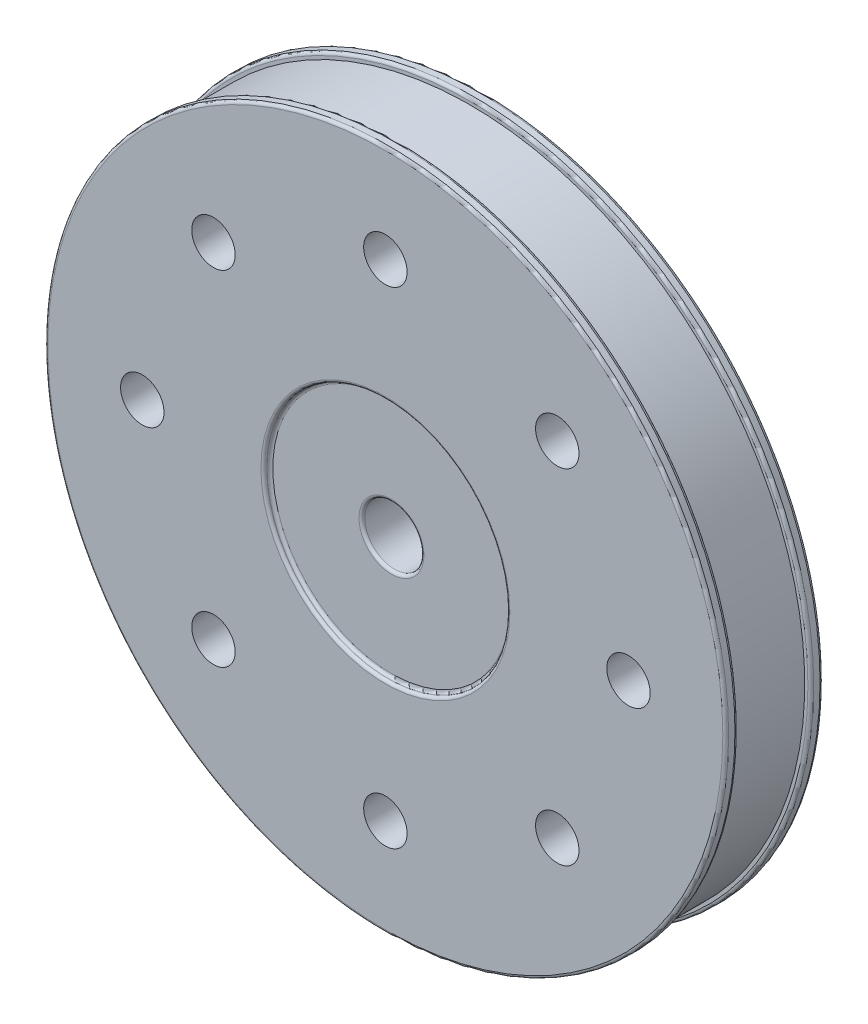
ISO-10303-21;
HEADER;
FILE_DESCRIPTION(('STEP AP214'),'2;1');
FILE_NAME('part.step','',(''),(''),'','','');
FILE_SCHEMA(('AUTOMOTIVE_DESIGN { 1 0 10303 214 1 1 1 1 }'));
ENDSEC;
DATA;
#1=APPLICATION_CONTEXT('core data for automotive mechanical design processes');
#2=APPLICATION_PROTOCOL_DEFINITION('international standard','automotive_design',2000,#1);
#3=PRODUCT_CONTEXT('',#1,'mechanical');
#4=PRODUCT('Part','Part','',(#3));
#5=PRODUCT_RELATED_PRODUCT_CATEGORY('part','',(#4));
#6=PRODUCT_DEFINITION_FORMATION('','',#4);
#7=PRODUCT_DEFINITION_CONTEXT('part definition',#1,'design');
#8=PRODUCT_DEFINITION('design','',#6,#7);
#9=PRODUCT_DEFINITION_SHAPE('','',#8);
#10=(LENGTH_UNIT() NAMED_UNIT(*) SI_UNIT(.MILLI.,.METRE.));
#11=(NAMED_UNIT(*) PLANE_ANGLE_UNIT() SI_UNIT($,.RADIAN.));
#12=(NAMED_UNIT(*) SI_UNIT($,.STERADIAN.) SOLID_ANGLE_UNIT());
#13=UNCERTAINTY_MEASURE_WITH_UNIT(LENGTH_MEASURE(1.E-05),#10,'distance_accuracy_value','');
#14=(GEOMETRIC_REPRESENTATION_CONTEXT(3) GLOBAL_UNCERTAINTY_ASSIGNED_CONTEXT((#13)) GLOBAL_UNIT_ASSIGNED_CONTEXT((#10,
#11,#12)) REPRESENTATION_CONTEXT('',''));
#15=CARTESIAN_POINT('',(0.,0.,0.));
#16=DIRECTION('',(0.,0.,1.));
#17=DIRECTION('',(1.,0.,0.));
#18=AXIS2_PLACEMENT_3D('',#15,#16,#17);
#19=CARTESIAN_POINT('',(0.,14.2875000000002,0.));
#20=DIRECTION('',(0.,0.,-1.));
#21=DIRECTION('',(-1.,0.,0.));
#22=AXIS2_PLACEMENT_3D('',#19,#20,#21);
#23=PLANE('',#22);
#24=CARTESIAN_POINT('',(0.,0.,0.));
#25=DIRECTION('',(0.,0.,1.));
#26=DIRECTION('',(1.,0.,0.));
#27=AXIS2_PLACEMENT_3D('',#24,#25,#26);
#28=CIRCLE('',#27,7.71795209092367);
#29=CARTESIAN_POINT('',(7.71795209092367,0.,0.));
#30=VERTEX_POINT('',#29);
#31=EDGE_CURVE('E101',#30,#30,#28,.T.);
#32=ORIENTED_EDGE('',*,*,#31,.T.);
#33=EDGE_LOOP('',(#32));
#34=FACE_BOUND('',#33,.T.);
#35=CARTESIAN_POINT('',(0.,0.,0.));
#36=DIRECTION('',(0.,0.,-1.));
#37=DIRECTION('',(-1.,0.,0.));
#38=AXIS2_PLACEMENT_3D('',#35,#36,#37);
#39=CIRCLE('',#38,14.2875);
#40=CARTESIAN_POINT('',(-14.2875,0.,0.));
#41=VERTEX_POINT('',#40);
#42=EDGE_CURVE('E83',#41,#41,#39,.T.);
#43=ORIENTED_EDGE('',*,*,#42,.T.);
#44=EDGE_LOOP('',(#43));
#45=FACE_BOUND('',#44,.T.);
#46=ADVANCED_FACE('F33',(#34,#45),#23,.T.);
#47=CARTESIAN_POINT('',(0.,0.,0.));
#48=DIRECTION('',(0.,0.,-1.));
#49=DIRECTION('',(-1.,0.,0.));
#50=AXIS2_PLACEMENT_3D('',#47,#48,#49);
#51=CYLINDRICAL_SURFACE('',#50,14.2875);
#52=CARTESIAN_POINT('',(2.22044604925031E-13,0.,20.6375));
#53=DIRECTION('',(0.,0.,-1.));
#54=DIRECTION('',(-1.,0.,0.));
#55=AXIS2_PLACEMENT_3D('',#52,#53,#54);
#56=CIRCLE('',#55,14.2875);
#57=CARTESIAN_POINT('',(-14.2874999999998,0.,20.6375));
#58=VERTEX_POINT('',#57);
#59=EDGE_CURVE('E86',#58,#58,#56,.T.);
#60=ORIENTED_EDGE('',*,*,#59,.T.);
#61=EDGE_LOOP('',(#60));
#62=FACE_BOUND('',#61,.T.);
#63=ORIENTED_EDGE('',*,*,#42,.F.);
#64=EDGE_LOOP('',(#63));
#65=FACE_BOUND('',#64,.T.);
#66=ADVANCED_FACE('F191',(#62,#65),#51,.T.);
#67=CARTESIAN_POINT('',(1.11022302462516E-13,31.7500000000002,20.6375));
#68=DIRECTION('',(0.,0.,-1.));
#69=DIRECTION('',(-1.,0.,0.));
#70=AXIS2_PLACEMENT_3D('',#67,#68,#69);
#71=PLANE('',#70);
#72=CARTESIAN_POINT('',(2.22044604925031E-13,0.,20.6375));
#73=DIRECTION('',(0.,0.,-1.));
#74=DIRECTION('',(-1.,0.,0.));
#75=AXIS2_PLACEMENT_3D('',#72,#73,#74);
#76=CIRCLE('',#75,31.75);
#77=CARTESIAN_POINT('',(-31.7499999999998,0.,20.6375));
#78=VERTEX_POINT('',#77);
#79=EDGE_CURVE('E89',#78,#78,#76,.T.);
#80=ORIENTED_EDGE('',*,*,#79,.T.);
#81=EDGE_LOOP('',(#80));
#82=FACE_BOUND('',#81,.T.);
#83=ORIENTED_EDGE('',*,*,#59,.F.);
#84=EDGE_LOOP('',(#83));
#85=FACE_BOUND('',#84,.T.);
#86=ADVANCED_FACE('F197',(#82,#85),#71,.T.);
#87=CARTESIAN_POINT('',(0.,0.,0.));
#88=DIRECTION('',(0.,0.,-1.));
#89=DIRECTION('',(-1.,0.,0.));
#90=AXIS2_PLACEMENT_3D('',#87,#88,#89);
#91=CYLINDRICAL_SURFACE('',#90,31.75);
#92=CARTESIAN_POINT('',(2.22044604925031E-13,0.,19.05));
#93=DIRECTION('',(0.,0.,-1.));
#94=DIRECTION('',(-1.,0.,0.));
#95=AXIS2_PLACEMENT_3D('',#92,#93,#94);
#96=CIRCLE('',#95,31.75);
#97=CARTESIAN_POINT('',(-31.7499999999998,0.,19.05));
#98=VERTEX_POINT('',#97);
#99=EDGE_CURVE('E92',#98,#98,#96,.T.);
#100=ORIENTED_EDGE('',*,*,#99,.T.);
#101=EDGE_LOOP('',(#100));
#102=FACE_BOUND('',#101,.T.);
#103=ORIENTED_EDGE('',*,*,#79,.F.);
#104=EDGE_LOOP('',(#103));
#105=FACE_BOUND('',#104,.T.);
#106=ADVANCED_FACE('F262',(#102,#105),#91,.F.);
#107=CARTESIAN_POINT('',(1.11022302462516E-13,88.9000000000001,19.05));
#108=DIRECTION('',(0.,0.,-1.));
#109=DIRECTION('',(-1.,0.,0.));
#110=AXIS2_PLACEMENT_3D('',#107,#108,#109);
#111=PLANE('',#110);
#112=CARTESIAN_POINT('',(44.9012806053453,44.9012806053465,19.05));
#113=DIRECTION('',(0.,0.,-1.));
#114=DIRECTION('',(-1.,0.,0.));
#115=AXIS2_PLACEMENT_3D('',#112,#113,#114);
#116=CIRCLE('',#115,5.67274811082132);
#117=CARTESIAN_POINT('',(39.228532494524,44.9012806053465,19.05));
#118=VERTEX_POINT('',#117);
#119=EDGE_CURVE('E146',#118,#118,#116,.T.);
#120=ORIENTED_EDGE('',*,*,#119,.F.);
#121=EDGE_LOOP('',(#120));
#122=FACE_BOUND('',#121,.T.);
#123=CARTESIAN_POINT('',(63.5000000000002,7.21644966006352E-13,19.05));
#124=DIRECTION('',(0.,0.,-1.));
#125=DIRECTION('',(-1.,0.,0.));
#126=AXIS2_PLACEMENT_3D('',#123,#124,#125);
#127=CIRCLE('',#126,5.67274811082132);
#128=CARTESIAN_POINT('',(57.8272518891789,7.21644966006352E-13,19.05));
#129=VERTEX_POINT('',#128);
#130=EDGE_CURVE('E140',#129,#129,#127,.T.);
#131=ORIENTED_EDGE('',*,*,#130,.F.);
#132=EDGE_LOOP('',(#131));
#133=FACE_BOUND('',#132,.T.);
#134=CARTESIAN_POINT('',(44.9012806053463,-44.9012806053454,19.05));
#135=DIRECTION('',(0.,0.,-1.));
#136=DIRECTION('',(-1.,0.,0.));
#137=AXIS2_PLACEMENT_3D('',#134,#135,#136);
#138=CIRCLE('',#137,5.67274811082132);
#139=CARTESIAN_POINT('',(39.2285324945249,-44.9012806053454,19.05));
#140=VERTEX_POINT('',#139);
#141=EDGE_CURVE('E134',#140,#140,#138,.T.);
#142=ORIENTED_EDGE('',*,*,#141,.F.);
#143=EDGE_LOOP('',(#142));
#144=FACE_BOUND('',#143,.T.);
#145=CARTESIAN_POINT('',(5.55111512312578E-13,-63.4999999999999,19.05));
#146=DIRECTION('',(0.,0.,-1.));
#147=DIRECTION('',(-1.,0.,0.));
#148=AXIS2_PLACEMENT_3D('',#145,#146,#147);
#149=CIRCLE('',#148,5.67274811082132);
#150=CARTESIAN_POINT('',(-5.67274811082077,-63.4999999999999,19.05));
#151=VERTEX_POINT('',#150);
#152=EDGE_CURVE('E128',#151,#151,#149,.T.);
#153=ORIENTED_EDGE('',*,*,#152,.F.);
#154=EDGE_LOOP('',(#153));
#155=FACE_BOUND('',#154,.T.);
#156=CARTESIAN_POINT('',(-44.9012806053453,-44.901280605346,19.05));
#157=DIRECTION('',(0.,0.,-1.));
#158=DIRECTION('',(-1.,0.,0.));
#159=AXIS2_PLACEMENT_3D('',#156,#157,#158);
#160=CIRCLE('',#159,5.67274811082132);
#161=CARTESIAN_POINT('',(-50.5740287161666,-44.901280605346,19.05));
#162=VERTEX_POINT('',#161);
#163=EDGE_CURVE('E122',#162,#162,#160,.T.);
#164=ORIENTED_EDGE('',*,*,#163,.F.);
#165=EDGE_LOOP('',(#164));
#166=FACE_BOUND('',#165,.T.);
#167=CARTESIAN_POINT('',(-63.4999999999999,0.,19.05));
#168=DIRECTION('',(0.,0.,-1.));
#169=DIRECTION('',(-1.,0.,0.));
#170=AXIS2_PLACEMENT_3D('',#167,#168,#169);
#171=CIRCLE('',#170,5.67274811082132);
#172=CARTESIAN_POINT('',(-69.1727481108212,0.,19.05));
#173=VERTEX_POINT('',#172);
#174=EDGE_CURVE('E116',#173,#173,#171,.T.);
#175=ORIENTED_EDGE('',*,*,#174,.F.);
#176=EDGE_LOOP('',(#175));
#177=FACE_BOUND('',#176,.T.);
#178=CARTESIAN_POINT('',(-44.9012806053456,44.9012806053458,19.05));
#179=DIRECTION('',(0.,0.,-1.));
#180=DIRECTION('',(-1.,0.,0.));
#181=AXIS2_PLACEMENT_3D('',#178,#179,#180);
#182=CIRCLE('',#181,5.67274811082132);
#183=CARTESIAN_POINT('',(-50.574028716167,44.9012806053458,19.05));
#184=VERTEX_POINT('',#183);
#185=EDGE_CURVE('E110',#184,#184,#182,.T.);
#186=ORIENTED_EDGE('',*,*,#185,.F.);
#187=EDGE_LOOP('',(#186));
#188=FACE_BOUND('',#187,.T.);
#189=CARTESIAN_POINT('',(2.22044604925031E-13,63.5,19.05));
#190=DIRECTION('',(0.,0.,-1.));
#191=DIRECTION('',(-1.,0.,0.));
#192=AXIS2_PLACEMENT_3D('',#189,#190,#191);
#193=CIRCLE('',#192,5.67274811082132);
#194=CARTESIAN_POINT('',(-5.6727481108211,63.5,19.05));
#195=VERTEX_POINT('',#194);
#196=EDGE_CURVE('E104',#195,#195,#193,.T.);
#197=ORIENTED_EDGE('',*,*,#196,.F.);
#198=EDGE_LOOP('',(#197));
#199=FACE_BOUND('',#198,.T.);
#200=CARTESIAN_POINT('',(2.22044604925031E-13,0.,19.05));
#201=DIRECTION('',(0.,0.,-1.));
#202=DIRECTION('',(-1.,0.,0.));
#203=AXIS2_PLACEMENT_3D('',#200,#201,#202);
#204=CIRCLE('',#203,88.138);
#205=CARTESIAN_POINT('',(-88.1379999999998,0.,19.05));
#206=VERTEX_POINT('',#205);
#207=EDGE_CURVE('E71',#206,#206,#204,.T.);
#208=ORIENTED_EDGE('',*,*,#207,.T.);
#209=EDGE_LOOP('',(#208));
#210=FACE_BOUND('',#209,.T.);
#211=ORIENTED_EDGE('',*,*,#99,.F.);
#212=EDGE_LOOP('',(#211));
#213=FACE_BOUND('',#212,.T.);
#214=ADVANCED_FACE('F258',(#122,#133,#144,#155,#166,#177,#188,#199,#210,#213),#111,.T.);
#215=CARTESIAN_POINT('',(0.,0.,0.));
#216=DIRECTION('',(0.,0.,-1.));
#217=DIRECTION('',(-1.,0.,0.));
#218=AXIS2_PLACEMENT_3D('',#215,#216,#217);
#219=CYLINDRICAL_SURFACE('',#218,88.9);
#220=CARTESIAN_POINT('',(2.22044604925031E-13,0.,19.812));
#221=DIRECTION('',(0.,0.,-1.));
#222=DIRECTION('',(-1.,0.,0.));
#223=AXIS2_PLACEMENT_3D('',#220,#221,#222);
#224=CIRCLE('',#223,88.9);
#225=CARTESIAN_POINT('',(-88.8999999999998,0.,19.812));
#226=VERTEX_POINT('',#225);
#227=EDGE_CURVE('E65',#226,#226,#224,.F.);
#228=ORIENTED_EDGE('',*,*,#227,.T.);
#229=EDGE_LOOP('',(#228));
#230=FACE_BOUND('',#229,.T.);
#231=CARTESIAN_POINT('',(2.22044604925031E-13,0.,21.463));
#232=DIRECTION('',(0.,0.,1.));
#233=DIRECTION('',(1.,0.,0.));
#234=AXIS2_PLACEMENT_3D('',#231,#232,#233);
#235=CIRCLE('',#234,88.9);
#236=CARTESIAN_POINT('',(88.9000000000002,0.,21.463));
#237=VERTEX_POINT('',#236);
#238=EDGE_CURVE('E68',#237,#237,#235,.F.);
#239=ORIENTED_EDGE('',*,*,#238,.T.);
#240=EDGE_LOOP('',(#239));
#241=FACE_BOUND('',#240,.T.);
#242=ADVANCED_FACE('F254',(#230,#241),#219,.T.);
#243=CARTESIAN_POINT('',(2.22044604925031E-13,87.3125000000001,22.225));
#244=DIRECTION('',(0.,0.,1.));
#245=DIRECTION('',(1.,0.,0.));
#246=AXIS2_PLACEMENT_3D('',#243,#244,#245);
#247=PLANE('',#246);
#248=CARTESIAN_POINT('',(2.22044604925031E-13,0.,22.225));
#249=DIRECTION('',(0.,0.,1.));
#250=DIRECTION('',(1.,0.,0.));
#251=AXIS2_PLACEMENT_3D('',#248,#249,#250);
#252=CIRCLE('',#251,88.138);
#253=CARTESIAN_POINT('',(88.1380000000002,0.,22.225));
#254=VERTEX_POINT('',#253);
#255=EDGE_CURVE('E62',#254,#254,#252,.T.);
#256=ORIENTED_EDGE('',*,*,#255,.T.);
#257=EDGE_LOOP('',(#256));
#258=FACE_BOUND('',#257,.T.);
#259=CARTESIAN_POINT('',(2.22044604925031E-13,0.,22.225));
#260=DIRECTION('',(0.,0.,-1.));
#261=DIRECTION('',(-1.,0.,0.));
#262=AXIS2_PLACEMENT_3D('',#259,#260,#261);
#263=CIRCLE('',#262,87.3125);
#264=CARTESIAN_POINT('',(-87.3124999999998,0.,22.225));
#265=VERTEX_POINT('',#264);
#266=EDGE_CURVE('E95',#265,#265,#263,.T.);
#267=ORIENTED_EDGE('',*,*,#266,.T.);
#268=EDGE_LOOP('',(#267));
#269=FACE_BOUND('',#268,.T.);
#270=ADVANCED_FACE('F250',(#258,#269),#247,.T.);
#271=CARTESIAN_POINT('',(0.,0.,0.));
#272=DIRECTION('',(0.,0.,-1.));
#273=DIRECTION('',(-1.,0.,0.));
#274=AXIS2_PLACEMENT_3D('',#271,#272,#273);
#275=CYLINDRICAL_SURFACE('',#274,87.3125);
#276=CARTESIAN_POINT('',(0.,0.,41.275));
#277=DIRECTION('',(0.,0.,-1.));
#278=DIRECTION('',(-1.,0.,0.));
#279=AXIS2_PLACEMENT_3D('',#276,#277,#278);
#280=CIRCLE('',#279,87.3125);
#281=CARTESIAN_POINT('',(-87.3125,0.,41.275));
#282=VERTEX_POINT('',#281);
#283=EDGE_CURVE('E98',#282,#282,#280,.T.);
#284=ORIENTED_EDGE('',*,*,#283,.T.);
#285=EDGE_LOOP('',(#284));
#286=FACE_BOUND('',#285,.T.);
#287=ORIENTED_EDGE('',*,*,#266,.F.);
#288=EDGE_LOOP('',(#287));
#289=FACE_BOUND('',#288,.T.);
#290=ADVANCED_FACE('F246',(#286,#289),#275,.T.);
#291=CARTESIAN_POINT('',(0.,88.9000000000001,41.275));
#292=DIRECTION('',(0.,0.,-1.));
#293=DIRECTION('',(-1.,0.,0.));
#294=AXIS2_PLACEMENT_3D('',#291,#292,#293);
#295=PLANE('',#294);
#296=CARTESIAN_POINT('',(0.,0.,41.275));
#297=DIRECTION('',(0.,0.,-1.));
#298=DIRECTION('',(-1.,0.,0.));
#299=AXIS2_PLACEMENT_3D('',#296,#297,#298);
#300=CIRCLE('',#299,88.138);
#301=CARTESIAN_POINT('',(-88.138,0.,41.275));
#302=VERTEX_POINT('',#301);
#303=EDGE_CURVE('E59',#302,#302,#300,.T.);
#304=ORIENTED_EDGE('',*,*,#303,.T.);
#305=EDGE_LOOP('',(#304));
#306=FACE_BOUND('',#305,.T.);
#307=ORIENTED_EDGE('',*,*,#283,.F.);
#308=EDGE_LOOP('',(#307));
#309=FACE_BOUND('',#308,.T.);
#310=ADVANCED_FACE('F242',(#306,#309),#295,.T.);
#311=CARTESIAN_POINT('',(0.,0.,0.));
#312=DIRECTION('',(0.,0.,-1.));
#313=DIRECTION('',(-1.,0.,0.));
#314=AXIS2_PLACEMENT_3D('',#311,#312,#313);
#315=CYLINDRICAL_SURFACE('',#314,88.9);
#316=CARTESIAN_POINT('',(0.,0.,42.037));
#317=DIRECTION('',(0.,0.,-1.));
#318=DIRECTION('',(-1.,0.,0.));
#319=AXIS2_PLACEMENT_3D('',#316,#317,#318);
#320=CIRCLE('',#319,88.9);
#321=CARTESIAN_POINT('',(-88.9,0.,42.037));
#322=VERTEX_POINT('',#321);
#323=EDGE_CURVE('E53',#322,#322,#320,.F.);
#324=ORIENTED_EDGE('',*,*,#323,.T.);
#325=EDGE_LOOP('',(#324));
#326=FACE_BOUND('',#325,.T.);
#327=CARTESIAN_POINT('',(0.,0.,43.688));
#328=DIRECTION('',(0.,0.,1.));
#329=DIRECTION('',(1.,0.,0.));
#330=AXIS2_PLACEMENT_3D('',#327,#328,#329);
#331=CIRCLE('',#330,88.9);
#332=CARTESIAN_POINT('',(88.9,0.,43.688));
#333=VERTEX_POINT('',#332);
#334=EDGE_CURVE('E56',#333,#333,#331,.F.);
#335=ORIENTED_EDGE('',*,*,#334,.T.);
#336=EDGE_LOOP('',(#335));
#337=FACE_BOUND('',#336,.T.);
#338=ADVANCED_FACE('F159',(#326,#337),#315,.T.);
#339=CARTESIAN_POINT('',(1.11022302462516E-13,31.7500000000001,44.45));
#340=DIRECTION('',(0.,0.,1.));
#341=DIRECTION('',(1.,0.,0.));
#342=AXIS2_PLACEMENT_3D('',#339,#340,#341);
#343=PLANE('',#342);
#344=CARTESIAN_POINT('',(44.9012806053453,44.9012806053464,44.45));
#345=DIRECTION('',(0.,0.,1.));
#346=DIRECTION('',(0.707106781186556,-0.707106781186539,0.));
#347=AXIS2_PLACEMENT_3D('',#344,#345,#346);
#348=CIRCLE('',#347,5.67274811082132);
#349=CARTESIAN_POINT('',(48.9125192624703,40.8900419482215,44.45));
#350=VERTEX_POINT('',#349);
#351=EDGE_CURVE('E149',#350,#350,#348,.T.);
#352=ORIENTED_EDGE('',*,*,#351,.F.);
#353=EDGE_LOOP('',(#352));
#354=FACE_BOUND('',#353,.T.);
#355=CARTESIAN_POINT('',(63.5,8.32667268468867E-13,44.45));
#356=DIRECTION('',(0.,0.,1.));
#357=DIRECTION('',(0.,-1.,0.));
#358=AXIS2_PLACEMENT_3D('',#355,#356,#357);
#359=CIRCLE('',#358,5.67274811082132);
#360=CARTESIAN_POINT('',(63.5000000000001,-5.67274811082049,44.45));
#361=VERTEX_POINT('',#360);
#362=EDGE_CURVE('E143',#361,#361,#359,.T.);
#363=ORIENTED_EDGE('',*,*,#362,.F.);
#364=EDGE_LOOP('',(#363));
#365=FACE_BOUND('',#364,.T.);
#366=CARTESIAN_POINT('',(44.9012806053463,-44.9012806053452,44.45));
#367=DIRECTION('',(0.,0.,1.));
#368=DIRECTION('',(-0.707106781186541,-0.707106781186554,0.));
#369=AXIS2_PLACEMENT_3D('',#366,#367,#368);
#370=CIRCLE('',#369,5.67274811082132);
#371=CARTESIAN_POINT('',(40.8900419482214,-48.9125192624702,44.45));
#372=VERTEX_POINT('',#371);
#373=EDGE_CURVE('E137',#372,#372,#370,.T.);
#374=ORIENTED_EDGE('',*,*,#373,.F.);
#375=EDGE_LOOP('',(#374));
#376=FACE_BOUND('',#375,.T.);
#377=CARTESIAN_POINT('',(5.55111512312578E-13,-63.4999999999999,44.45));
#378=DIRECTION('',(0.,0.,1.));
#379=DIRECTION('',(-1.,0.,0.));
#380=AXIS2_PLACEMENT_3D('',#377,#378,#379);
#381=CIRCLE('',#380,5.67274811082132);
#382=CARTESIAN_POINT('',(-5.67274811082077,-63.5,44.45));
#383=VERTEX_POINT('',#382);
#384=EDGE_CURVE('E131',#383,#383,#381,.T.);
#385=ORIENTED_EDGE('',*,*,#384,.F.);
#386=EDGE_LOOP('',(#385));
#387=FACE_BOUND('',#386,.T.);
#388=CARTESIAN_POINT('',(-44.9012806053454,-44.901280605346,44.45));
#389=DIRECTION('',(0.,0.,1.));
#390=DIRECTION('',(-0.707106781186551,0.707106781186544,0.));
#391=AXIS2_PLACEMENT_3D('',#388,#389,#390);
#392=CIRCLE('',#391,5.67274811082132);
#393=CARTESIAN_POINT('',(-48.9125192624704,-40.8900419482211,44.45));
#394=VERTEX_POINT('',#393);
#395=EDGE_CURVE('E125',#394,#394,#392,.T.);
#396=ORIENTED_EDGE('',*,*,#395,.F.);
#397=EDGE_LOOP('',(#396));
#398=FACE_BOUND('',#397,.T.);
#399=CARTESIAN_POINT('',(-63.5,0.,44.45));
#400=DIRECTION('',(0.,0.,1.));
#401=DIRECTION('',(0.,1.,0.));
#402=AXIS2_PLACEMENT_3D('',#399,#400,#401);
#403=CIRCLE('',#402,5.67274811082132);
#404=CARTESIAN_POINT('',(-63.5,5.67274811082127,44.45));
#405=VERTEX_POINT('',#404);
#406=EDGE_CURVE('E119',#405,#405,#403,.T.);
#407=ORIENTED_EDGE('',*,*,#406,.F.);
#408=EDGE_LOOP('',(#407));
#409=FACE_BOUND('',#408,.T.);
#410=CARTESIAN_POINT('',(-44.9012806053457,44.9012806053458,44.45));
#411=DIRECTION('',(0.,0.,1.));
#412=DIRECTION('',(0.707106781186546,0.707106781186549,0.));
#413=AXIS2_PLACEMENT_3D('',#410,#411,#412);
#414=CIRCLE('',#413,5.67274811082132);
#415=CARTESIAN_POINT('',(-40.8900419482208,48.9125192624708,44.45));
#416=VERTEX_POINT('',#415);
#417=EDGE_CURVE('E113',#416,#416,#414,.T.);
#418=ORIENTED_EDGE('',*,*,#417,.F.);
#419=EDGE_LOOP('',(#418));
#420=FACE_BOUND('',#419,.T.);
#421=CARTESIAN_POINT('',(1.11022302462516E-13,63.5000000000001,44.45));
#422=DIRECTION('',(0.,0.,1.));
#423=DIRECTION('',(1.,0.,0.));
#424=AXIS2_PLACEMENT_3D('',#421,#422,#423);
#425=CIRCLE('',#424,5.67274811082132);
#426=CARTESIAN_POINT('',(5.67274811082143,63.5000000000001,44.45));
#427=VERTEX_POINT('',#426);
#428=EDGE_CURVE('E107',#427,#427,#425,.T.);
#429=ORIENTED_EDGE('',*,*,#428,.F.);
#430=EDGE_LOOP('',(#429));
#431=FACE_BOUND('',#430,.T.);
#432=CARTESIAN_POINT('',(0.,0.,44.45));
#433=DIRECTION('',(0.,0.,1.));
#434=DIRECTION('',(1.,0.,0.));
#435=AXIS2_PLACEMENT_3D('',#432,#433,#434);
#436=CIRCLE('',#435,32.512);
#437=CARTESIAN_POINT('',(32.512,0.,44.45));
#438=VERTEX_POINT('',#437);
#439=EDGE_CURVE('E10',#438,#438,#436,.F.);
#440=ORIENTED_EDGE('',*,*,#439,.T.);
#441=EDGE_LOOP('',(#440));
#442=FACE_BOUND('',#441,.T.);
#443=CARTESIAN_POINT('',(0.,0.,44.45));
#444=DIRECTION('',(0.,0.,1.));
#445=DIRECTION('',(1.,0.,0.));
#446=AXIS2_PLACEMENT_3D('',#443,#444,#445);
#447=CIRCLE('',#446,88.138);
#448=CARTESIAN_POINT('',(88.138,0.,44.45));
#449=VERTEX_POINT('',#448);
#450=EDGE_CURVE('E40',#449,#449,#447,.T.);
#451=ORIENTED_EDGE('',*,*,#450,.T.);
#452=EDGE_LOOP('',(#451));
#453=FACE_BOUND('',#452,.T.);
#454=ADVANCED_FACE('F155',(#354,#365,#376,#387,#398,#409,#420,#431,#442,#453),#343,.T.);
#455=CARTESIAN_POINT('',(0.,0.,0.));
#456=DIRECTION('',(0.,0.,-1.));
#457=DIRECTION('',(-1.,0.,0.));
#458=AXIS2_PLACEMENT_3D('',#455,#456,#457);
#459=CYLINDRICAL_SURFACE('',#458,31.75);
#460=CARTESIAN_POINT('',(0.,0.,43.6245));
#461=DIRECTION('',(0.,0.,1.));
#462=DIRECTION('',(1.,0.,0.));
#463=AXIS2_PLACEMENT_3D('',#460,#461,#462);
#464=CIRCLE('',#463,31.75);
#465=CARTESIAN_POINT('',(31.75,0.,43.6245));
#466=VERTEX_POINT('',#465);
#467=EDGE_CURVE('E44',#466,#466,#464,.F.);
#468=ORIENTED_EDGE('',*,*,#467,.T.);
#469=EDGE_LOOP('',(#468));
#470=FACE_BOUND('',#469,.T.);
#471=CARTESIAN_POINT('',(0.,0.,43.688));
#472=DIRECTION('',(0.,0.,1.));
#473=DIRECTION('',(1.,0.,0.));
#474=AXIS2_PLACEMENT_3D('',#471,#472,#473);
#475=CIRCLE('',#474,31.75);
#476=CARTESIAN_POINT('',(31.75,0.,43.688));
#477=VERTEX_POINT('',#476);
#478=EDGE_CURVE('E48',#477,#477,#475,.T.);
#479=ORIENTED_EDGE('',*,*,#478,.T.);
#480=EDGE_LOOP('',(#479));
#481=FACE_BOUND('',#480,.T.);
#482=ADVANCED_FACE('F158',(#470,#481),#459,.F.);
#483=CARTESIAN_POINT('',(1.11022302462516E-13,31.7500000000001,42.8625));
#484=DIRECTION('',(0.,0.,1.));
#485=DIRECTION('',(1.,0.,0.));
#486=AXIS2_PLACEMENT_3D('',#483,#484,#485);
#487=PLANE('',#486);
#488=CARTESIAN_POINT('',(0.,0.,42.8625));
#489=DIRECTION('',(0.,0.,1.));
#490=DIRECTION('',(1.,0.,0.));
#491=AXIS2_PLACEMENT_3D('',#488,#489,#490);
#492=CIRCLE('',#491,8.47995209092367);
#493=CARTESIAN_POINT('',(8.47995209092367,0.,42.8625));
#494=VERTEX_POINT('',#493);
#495=EDGE_CURVE('E74',#494,#494,#492,.F.);
#496=ORIENTED_EDGE('',*,*,#495,.T.);
#497=EDGE_LOOP('',(#496));
#498=FACE_BOUND('',#497,.T.);
#499=CARTESIAN_POINT('',(0.,0.,42.8625));
#500=DIRECTION('',(0.,0.,1.));
#501=DIRECTION('',(1.,0.,0.));
#502=AXIS2_PLACEMENT_3D('',#499,#500,#501);
#503=CIRCLE('',#502,30.988);
#504=CARTESIAN_POINT('',(30.988,0.,42.8625));
#505=VERTEX_POINT('',#504);
#506=EDGE_CURVE('E77',#505,#505,#503,.T.);
#507=ORIENTED_EDGE('',*,*,#506,.T.);
#508=EDGE_LOOP('',(#507));
#509=FACE_BOUND('',#508,.T.);
#510=ADVANCED_FACE('F231',(#498,#509),#487,.T.);
#511=CARTESIAN_POINT('',(0.,0.,0.));
#512=DIRECTION('',(0.,0.,1.));
#513=DIRECTION('',(1.,0.,0.));
#514=AXIS2_PLACEMENT_3D('',#511,#512,#513);
#515=CYLINDRICAL_SURFACE('',#514,7.71795209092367);
#516=CARTESIAN_POINT('',(0.,0.,42.1005));
#517=DIRECTION('',(0.,0.,1.));
#518=DIRECTION('',(1.,0.,0.));
#519=AXIS2_PLACEMENT_3D('',#516,#517,#518);
#520=CIRCLE('',#519,7.71795209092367);
#521=CARTESIAN_POINT('',(7.71795209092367,0.,42.1005));
#522=VERTEX_POINT('',#521);
#523=EDGE_CURVE('E80',#522,#522,#520,.T.);
#524=ORIENTED_EDGE('',*,*,#523,.T.);
#525=EDGE_LOOP('',(#524));
#526=FACE_BOUND('',#525,.T.);
#527=ORIENTED_EDGE('',*,*,#31,.F.);
#528=EDGE_LOOP('',(#527));
#529=FACE_BOUND('',#528,.T.);
#530=ADVANCED_FACE('F207',(#526,#529),#515,.F.);
#531=CARTESIAN_POINT('',(0.,0.,42.1005));
#532=DIRECTION('',(0.,0.,1.));
#533=DIRECTION('',(1.,0.,0.));
#534=AXIS2_PLACEMENT_3D('',#531,#532,#533);
#535=TOROIDAL_SURFACE('',#534,8.47995209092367,0.762);
#536=ORIENTED_EDGE('',*,*,#495,.F.);
#537=EDGE_LOOP('',(#536));
#538=FACE_BOUND('',#537,.T.);
#539=ORIENTED_EDGE('',*,*,#523,.F.);
#540=EDGE_LOOP('',(#539));
#541=FACE_BOUND('',#540,.T.);
#542=ADVANCED_FACE('F203',(#538,#541),#535,.T.);
#543=CARTESIAN_POINT('',(2.22044604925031E-13,0.,19.812));
#544=DIRECTION('',(0.,0.,-1.));
#545=DIRECTION('',(-1.,0.,0.));
#546=AXIS2_PLACEMENT_3D('',#543,#544,#545);
#547=TOROIDAL_SURFACE('',#546,88.138,0.762);
#548=ORIENTED_EDGE('',*,*,#227,.F.);
#549=EDGE_LOOP('',(#548));
#550=FACE_BOUND('',#549,.T.);
#551=ORIENTED_EDGE('',*,*,#207,.F.);
#552=EDGE_LOOP('',(#551));
#553=FACE_BOUND('',#552,.T.);
#554=ADVANCED_FACE('F206',(#550,#553),#547,.T.);
#555=CARTESIAN_POINT('',(2.22044604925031E-13,0.,21.463));
#556=DIRECTION('',(0.,0.,1.));
#557=DIRECTION('',(1.,0.,0.));
#558=AXIS2_PLACEMENT_3D('',#555,#556,#557);
#559=TOROIDAL_SURFACE('',#558,88.138,0.762);
#560=ORIENTED_EDGE('',*,*,#255,.F.);
#561=EDGE_LOOP('',(#560));
#562=FACE_BOUND('',#561,.T.);
#563=ORIENTED_EDGE('',*,*,#238,.F.);
#564=EDGE_LOOP('',(#563));
#565=FACE_BOUND('',#564,.T.);
#566=ADVANCED_FACE('F211',(#562,#565),#559,.T.);
#567=CARTESIAN_POINT('',(0.,0.,42.037));
#568=DIRECTION('',(0.,0.,-1.));
#569=DIRECTION('',(-1.,0.,0.));
#570=AXIS2_PLACEMENT_3D('',#567,#568,#569);
#571=TOROIDAL_SURFACE('',#570,88.138,0.762);
#572=ORIENTED_EDGE('',*,*,#323,.F.);
#573=EDGE_LOOP('',(#572));
#574=FACE_BOUND('',#573,.T.);
#575=ORIENTED_EDGE('',*,*,#303,.F.);
#576=EDGE_LOOP('',(#575));
#577=FACE_BOUND('',#576,.T.);
#578=ADVANCED_FACE('F215',(#574,#577),#571,.T.);
#579=CARTESIAN_POINT('',(0.,0.,43.6245));
#580=DIRECTION('',(0.,0.,1.));
#581=DIRECTION('',(1.,0.,0.));
#582=AXIS2_PLACEMENT_3D('',#579,#580,#581);
#583=TOROIDAL_SURFACE('',#582,30.988,0.762);
#584=ORIENTED_EDGE('',*,*,#506,.F.);
#585=EDGE_LOOP('',(#584));
#586=FACE_BOUND('',#585,.T.);
#587=ORIENTED_EDGE('',*,*,#467,.F.);
#588=EDGE_LOOP('',(#587));
#589=FACE_BOUND('',#588,.T.);
#590=ADVANCED_FACE('F219',(#586,#589),#583,.F.);
#591=CARTESIAN_POINT('',(0.,0.,43.688));
#592=DIRECTION('',(0.,0.,1.));
#593=DIRECTION('',(1.,0.,0.));
#594=AXIS2_PLACEMENT_3D('',#591,#592,#593);
#595=TOROIDAL_SURFACE('',#594,32.512,0.762);
#596=ORIENTED_EDGE('',*,*,#478,.F.);
#597=EDGE_LOOP('',(#596));
#598=FACE_BOUND('',#597,.T.);
#599=ORIENTED_EDGE('',*,*,#439,.F.);
#600=EDGE_LOOP('',(#599));
#601=FACE_BOUND('',#600,.T.);
#602=ADVANCED_FACE('F187',(#598,#601),#595,.T.);
#603=CARTESIAN_POINT('',(0.,0.,43.688));
#604=DIRECTION('',(0.,0.,1.));
#605=DIRECTION('',(1.,0.,0.));
#606=AXIS2_PLACEMENT_3D('',#603,#604,#605);
#607=TOROIDAL_SURFACE('',#606,88.138,0.762);
#608=ORIENTED_EDGE('',*,*,#450,.F.);
#609=EDGE_LOOP('',(#608));
#610=FACE_BOUND('',#609,.T.);
#611=ORIENTED_EDGE('',*,*,#334,.F.);
#612=EDGE_LOOP('',(#611));
#613=FACE_BOUND('',#612,.T.);
#614=ADVANCED_FACE('F35',(#610,#613),#607,.T.);
#615=CARTESIAN_POINT('',(1.11022302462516E-13,63.5000000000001,0.));
#616=DIRECTION('',(0.,0.,1.));
#617=DIRECTION('',(1.,0.,0.));
#618=AXIS2_PLACEMENT_3D('',#615,#616,#617);
#619=CYLINDRICAL_SURFACE('',#618,5.67274811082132);
#620=ORIENTED_EDGE('',*,*,#196,.T.);
#621=EDGE_LOOP('',(#620));
#622=FACE_BOUND('',#621,.T.);
#623=ORIENTED_EDGE('',*,*,#428,.T.);
#624=EDGE_LOOP('',(#623));
#625=FACE_BOUND('',#624,.T.);
#626=ADVANCED_FACE('F175',(#622,#625),#619,.F.);
#627=CARTESIAN_POINT('',(-44.9012806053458,44.9012806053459,0.));
#628=DIRECTION('',(0.,0.,1.));
#629=DIRECTION('',(1.,0.,0.));
#630=AXIS2_PLACEMENT_3D('',#627,#628,#629);
#631=CYLINDRICAL_SURFACE('',#630,5.67274811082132);
#632=ORIENTED_EDGE('',*,*,#185,.T.);
#633=EDGE_LOOP('',(#632));
#634=FACE_BOUND('',#633,.T.);
#635=ORIENTED_EDGE('',*,*,#417,.T.);
#636=EDGE_LOOP('',(#635));
#637=FACE_BOUND('',#636,.T.);
#638=ADVANCED_FACE('F177',(#634,#637),#631,.F.);
#639=CARTESIAN_POINT('',(-63.4999999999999,0.,0.));
#640=DIRECTION('',(0.,0.,1.));
#641=DIRECTION('',(1.,0.,0.));
#642=AXIS2_PLACEMENT_3D('',#639,#640,#641);
#643=CYLINDRICAL_SURFACE('',#642,5.67274811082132);
#644=ORIENTED_EDGE('',*,*,#174,.T.);
#645=EDGE_LOOP('',(#644));
#646=FACE_BOUND('',#645,.T.);
#647=ORIENTED_EDGE('',*,*,#406,.T.);
#648=EDGE_LOOP('',(#647));
#649=FACE_BOUND('',#648,.T.);
#650=ADVANCED_FACE('F184',(#646,#649),#643,.F.);
#651=CARTESIAN_POINT('',(-44.9012806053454,-44.901280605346,0.));
#652=DIRECTION('',(0.,0.,1.));
#653=DIRECTION('',(1.,0.,0.));
#654=AXIS2_PLACEMENT_3D('',#651,#652,#653);
#655=CYLINDRICAL_SURFACE('',#654,5.67274811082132);
#656=ORIENTED_EDGE('',*,*,#163,.T.);
#657=EDGE_LOOP('',(#656));
#658=FACE_BOUND('',#657,.T.);
#659=ORIENTED_EDGE('',*,*,#395,.T.);
#660=EDGE_LOOP('',(#659));
#661=FACE_BOUND('',#660,.T.);
#662=ADVANCED_FACE('F361',(#658,#661),#655,.F.);
#663=CARTESIAN_POINT('',(5.55111512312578E-13,-63.4999999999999,0.));
#664=DIRECTION('',(0.,0.,1.));
#665=DIRECTION('',(1.,0.,0.));
#666=AXIS2_PLACEMENT_3D('',#663,#664,#665);
#667=CYLINDRICAL_SURFACE('',#666,5.67274811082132);
#668=ORIENTED_EDGE('',*,*,#152,.T.);
#669=EDGE_LOOP('',(#668));
#670=FACE_BOUND('',#669,.T.);
#671=ORIENTED_EDGE('',*,*,#384,.T.);
#672=EDGE_LOOP('',(#671));
#673=FACE_BOUND('',#672,.T.);
#674=ADVANCED_FACE('F369',(#670,#673),#667,.F.);
#675=CARTESIAN_POINT('',(44.9012806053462,-44.9012806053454,0.));
#676=DIRECTION('',(0.,0.,1.));
#677=DIRECTION('',(1.,0.,0.));
#678=AXIS2_PLACEMENT_3D('',#675,#676,#677);
#679=CYLINDRICAL_SURFACE('',#678,5.67274811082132);
#680=ORIENTED_EDGE('',*,*,#141,.T.);
#681=EDGE_LOOP('',(#680));
#682=FACE_BOUND('',#681,.T.);
#683=ORIENTED_EDGE('',*,*,#373,.T.);
#684=EDGE_LOOP('',(#683));
#685=FACE_BOUND('',#684,.T.);
#686=ADVANCED_FACE('F377',(#682,#685),#679,.F.);
#687=CARTESIAN_POINT('',(63.5,6.66133814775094E-13,0.));
#688=DIRECTION('',(0.,0.,1.));
#689=DIRECTION('',(1.,0.,0.));
#690=AXIS2_PLACEMENT_3D('',#687,#688,#689);
#691=CYLINDRICAL_SURFACE('',#690,5.67274811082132);
#692=ORIENTED_EDGE('',*,*,#130,.T.);
#693=EDGE_LOOP('',(#692));
#694=FACE_BOUND('',#693,.T.);
#695=ORIENTED_EDGE('',*,*,#362,.T.);
#696=EDGE_LOOP('',(#695));
#697=FACE_BOUND('',#696,.T.);
#698=ADVANCED_FACE('F385',(#694,#697),#691,.F.);
#699=CARTESIAN_POINT('',(44.9012806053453,44.9012806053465,0.));
#700=DIRECTION('',(0.,0.,1.));
#701=DIRECTION('',(1.,0.,0.));
#702=AXIS2_PLACEMENT_3D('',#699,#700,#701);
#703=CYLINDRICAL_SURFACE('',#702,5.67274811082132);
#704=ORIENTED_EDGE('',*,*,#119,.T.);
#705=EDGE_LOOP('',(#704));
#706=FACE_BOUND('',#705,.T.);
#707=ORIENTED_EDGE('',*,*,#351,.T.);
#708=EDGE_LOOP('',(#707));
#709=FACE_BOUND('',#708,.T.);
#710=ADVANCED_FACE('F153',(#706,#709),#703,.F.);
#711=CLOSED_SHELL('',(#46,#66,#86,#106,#214,#242,#270,#290,#310,#338,#454,#482,#510,#530,#542,
#554,#566,#578,#590,#602,#614,#626,#638,#650,#662,#674,#686,#698,#710));
#712=MANIFOLD_SOLID_BREP('B2',#711);
#713=ADVANCED_BREP_SHAPE_REPRESENTATION('',(#18,#712),#14);
#714=SHAPE_DEFINITION_REPRESENTATION(#9,#713);
ENDSEC;
END-ISO-10303-21;
